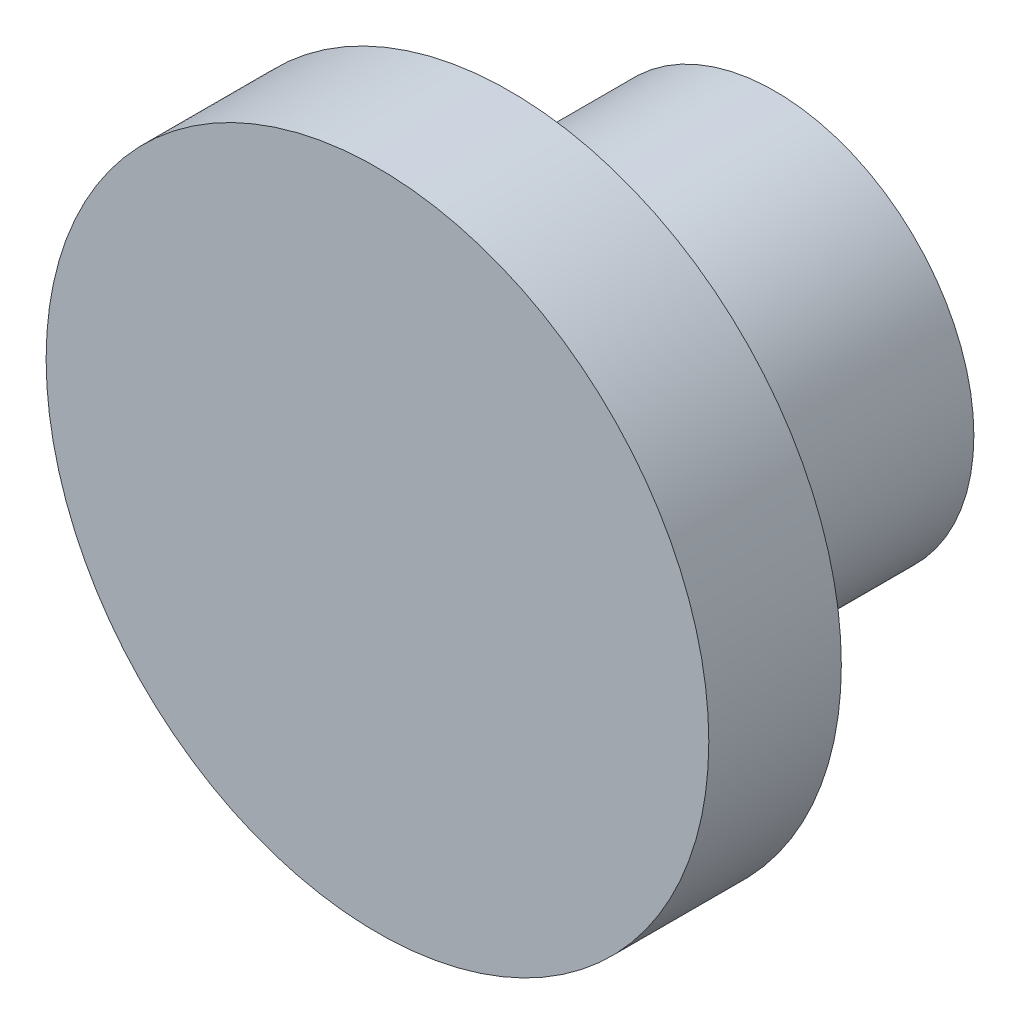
from build123d import *

# Parameters (mm, degrees)
ESQUISSE1_R          = 15
ESQUISSE1_R_2        = 8
BASE_EXTRUSION_DEPTH = 20
ESQUISSE2_R          = 25
BOSS_EXTRU_1_DEPTH   = 10


with BuildPart() as part:
    # Esquisse1 → Base-Extrusion (new body)
    with BuildSketch(Plane.XY):
        with Locations((35, 60)):
            Circle(ESQUISSE1_R)
        with Locations((35, 60)):
            Circle(ESQUISSE1_R_2, mode=Mode.SUBTRACT)
    extrude(amount=-BASE_EXTRUSION_DEPTH)

    # Esquisse2 → Boss.-Extru.1 (add)
    with BuildSketch(Plane.XY):
        with Locations((35, 60)):
            Circle(ESQUISSE2_R)
    extrude(amount=BOSS_EXTRU_1_DEPTH)


solid = part.part
